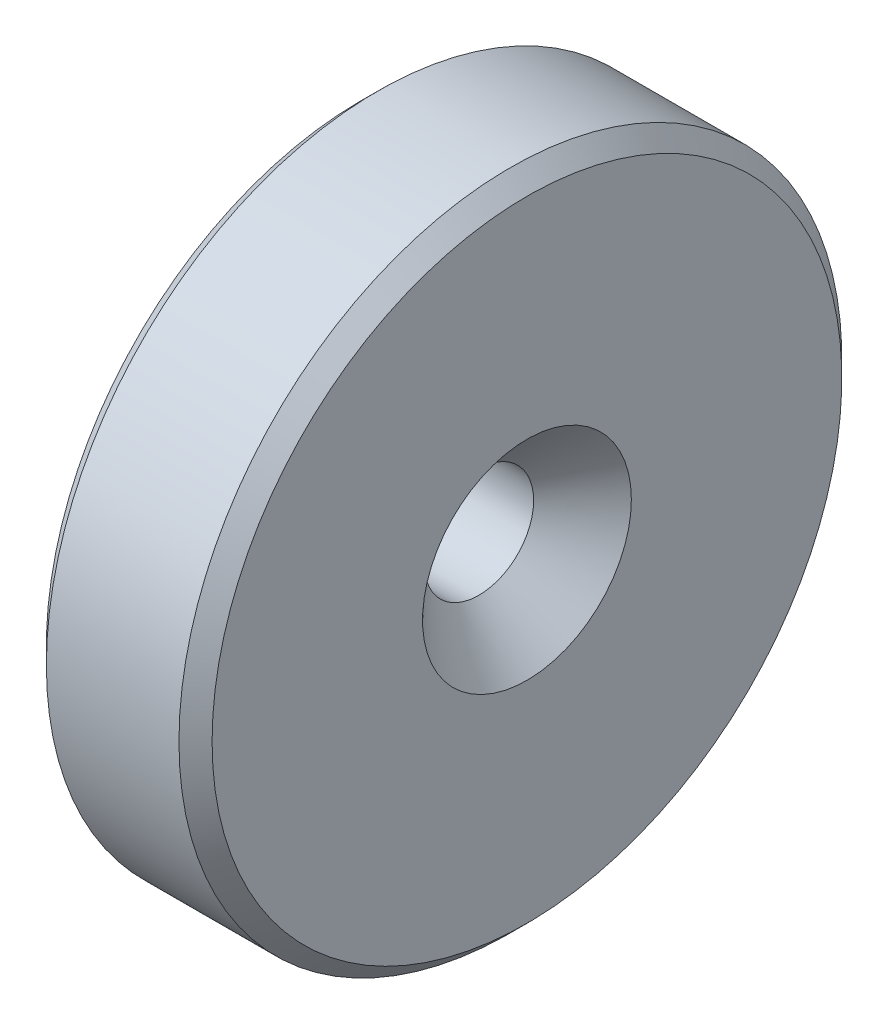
from build123d import *

# Parameters (mm, degrees)
ESQUISSE1_W             = 10
ESQUISSE1_H             = 20
CHANFREIN1_SIZE         = 1
PER_AGE1_D              = 6.6
PER_AGE1_CSINK_D        = 12.6
PER_AGE1_CSINK_ANGLE    = 92
ESQUISSE5_W             = 2.1
ESQUISSE5_H             = 0.25
ENL_V_MAT_EXTRU_1_DEPTH = 20


with BuildPart() as part:
    # Esquisse1 → Base-R_volution (revolve)
    with BuildSketch(Plane.XY, mode=Mode.PRIVATE) as base_r_volution_sk:
        with Locations((5, 10)):
            Rectangle(ESQUISSE1_W, ESQUISSE1_H)
    revolve(base_r_volution_sk.sketch.rotate(Axis((0, 0, 0), (1, 0, 0)), 270), axis=Axis((0, 0, 0), (1, 0, 0)))

    # Chanfrein1
    chanfrein1_edges = [part.edges().sort_by_distance(p)[0] for p in [
        (10, 0, 20),
        (0, 0, 20),
    ]]
    chamfer(chanfrein1_edges, length=CHANFREIN1_SIZE)

    # Per_age1 (through all)
    with Locations(Plane(origin=(10, 0, 0), x_dir=(0, 0, -1), z_dir=(1, 0, 0))):
        with Locations((0, 0)):
            CounterSinkHole(PER_AGE1_D / 2, PER_AGE1_CSINK_D / 2, counter_sink_angle=PER_AGE1_CSINK_ANGLE)

    # Esquisse5 → Enl_v. mat.-Extru.1 (cut, symmetric)
    with BuildSketch(Plane(origin=(0, 0, 0), x_dir=(1, 0, 0), z_dir=(0, 1, 0))):
        with Locations((-0.95, 0)):
            Rectangle(ESQUISSE5_W, ESQUISSE5_H)
    extrude(amount=ENL_V_MAT_EXTRU_1_DEPTH, both=True, mode=Mode.SUBTRACT)


solid = part.part
